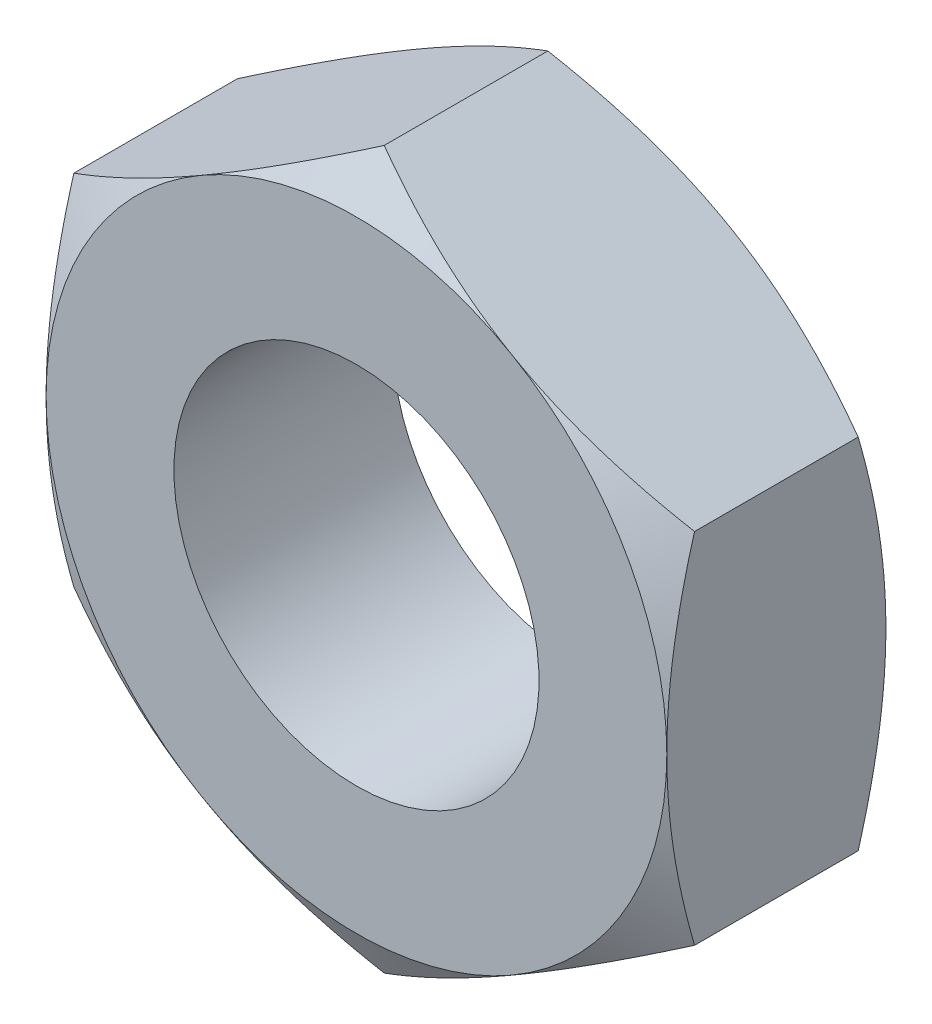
ISO-10303-21;
HEADER;
FILE_DESCRIPTION(('STEP AP214'),'2;1');
FILE_NAME('part.step','',(''),(''),'','','');
FILE_SCHEMA(('AUTOMOTIVE_DESIGN { 1 0 10303 214 1 1 1 1 }'));
ENDSEC;
DATA;
#1=APPLICATION_CONTEXT('core data for automotive mechanical design processes');
#2=APPLICATION_PROTOCOL_DEFINITION('international standard','automotive_design',2000,#1);
#3=PRODUCT_CONTEXT('',#1,'mechanical');
#4=PRODUCT('Part','Part','',(#3));
#5=PRODUCT_RELATED_PRODUCT_CATEGORY('part','',(#4));
#6=PRODUCT_DEFINITION_FORMATION('','',#4);
#7=PRODUCT_DEFINITION_CONTEXT('part definition',#1,'design');
#8=PRODUCT_DEFINITION('design','',#6,#7);
#9=PRODUCT_DEFINITION_SHAPE('','',#8);
#10=(LENGTH_UNIT() NAMED_UNIT(*) SI_UNIT(.MILLI.,.METRE.));
#11=(NAMED_UNIT(*) PLANE_ANGLE_UNIT() SI_UNIT($,.RADIAN.));
#12=(NAMED_UNIT(*) SI_UNIT($,.STERADIAN.) SOLID_ANGLE_UNIT());
#13=UNCERTAINTY_MEASURE_WITH_UNIT(LENGTH_MEASURE(1.E-05),#10,'distance_accuracy_value','');
#14=(GEOMETRIC_REPRESENTATION_CONTEXT(3) GLOBAL_UNCERTAINTY_ASSIGNED_CONTEXT((#13)) GLOBAL_UNIT_ASSIGNED_CONTEXT((#10,
#11,#12)) REPRESENTATION_CONTEXT('',''));
#15=CARTESIAN_POINT('',(0.,0.,0.));
#16=DIRECTION('',(0.,0.,1.));
#17=DIRECTION('',(1.,0.,0.));
#18=AXIS2_PLACEMENT_3D('',#15,#16,#17);
#19=CARTESIAN_POINT('',(-8.5,-4.90747728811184,8.));
#20=DIRECTION('',(-1.,0.,0.));
#21=DIRECTION('',(0.,0.,1.));
#22=AXIS2_PLACEMENT_3D('',#19,#20,#21);
#23=PLANE('',#22);
#24=CARTESIAN_POINT('',(-8.5,-13.1914833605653,4.15278822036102));
#25=CARTESIAN_POINT('',(-8.49999999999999,-12.8201614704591,3.9726260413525));
#26=CARTESIAN_POINT('',(-8.49999999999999,-12.4479882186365,3.79418857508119));
#27=CARTESIAN_POINT('',(-8.49999999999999,-11.7014862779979,3.44173285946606));
#28=CARTESIAN_POINT('',(-8.49999999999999,-11.3271572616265,3.26771530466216));
#29=CARTESIAN_POINT('',(-8.49999999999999,-10.5739668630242,2.92419570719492));
#30=CARTESIAN_POINT('',(-8.49999999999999,-10.195091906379,2.75472332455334));
#31=CARTESIAN_POINT('',(-8.49999999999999,-9.43433200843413,2.42270108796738));
#32=CARTESIAN_POINT('',(-8.49999999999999,-9.05244721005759,2.26015090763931));
#33=CARTESIAN_POINT('',(-8.49999999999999,-8.27268041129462,1.93869686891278));
#34=CARTESIAN_POINT('',(-8.5,-7.87467962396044,1.78007956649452));
#35=CARTESIAN_POINT('',(-8.5,-7.07402609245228,1.47482689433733));
#36=CARTESIAN_POINT('',(-8.5,-6.67137283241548,1.32819286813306));
#37=CARTESIAN_POINT('',(-8.5,-5.86151956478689,1.05074981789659));
#38=CARTESIAN_POINT('',(-8.5,-5.45433062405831,0.919908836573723));
#39=CARTESIAN_POINT('',(-8.5,-4.6341262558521,0.678242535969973));
#40=CARTESIAN_POINT('',(-8.5,-4.22111270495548,0.567410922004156));
#41=CARTESIAN_POINT('',(-8.5,-3.39125960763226,0.371675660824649));
#42=CARTESIAN_POINT('',(-8.50000000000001,-2.97445435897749,0.286630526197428));
#43=CARTESIAN_POINT('',(-8.50000000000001,-2.34544327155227,0.182077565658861));
#44=CARTESIAN_POINT('',(-8.50000000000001,-2.13512362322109,0.151060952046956));
#45=CARTESIAN_POINT('',(-8.50000000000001,-1.7134357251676,0.0973074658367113));
#46=CARTESIAN_POINT('',(-8.50000000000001,-1.50206757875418,0.0745697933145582));
#47=CARTESIAN_POINT('',(-8.50000000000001,-1.08133091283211,0.0381128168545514));
#48=CARTESIAN_POINT('',(-8.50000000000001,-0.871972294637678,0.0242796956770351));
#49=CARTESIAN_POINT('',(-8.50000000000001,-0.452857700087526,0.00547961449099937));
#50=CARTESIAN_POINT('',(-8.50000000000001,-0.243101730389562,0.000512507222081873));
#51=CARTESIAN_POINT('',(-8.50000000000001,0.176432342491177,-0.000437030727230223));
#52=CARTESIAN_POINT('',(-8.50000000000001,0.386210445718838,0.00358055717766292));
#53=CARTESIAN_POINT('',(-8.50000000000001,0.805410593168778,0.0205020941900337));
#54=CARTESIAN_POINT('',(-8.5,1.01483261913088,0.0334064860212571));
#55=CARTESIAN_POINT('',(-8.5,1.51786363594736,0.0748028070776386));
#56=CARTESIAN_POINT('',(-8.50000000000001,1.8111342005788,0.107496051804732));
#57=CARTESIAN_POINT('',(-8.50000000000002,2.3954909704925,0.188528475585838));
#58=CARTESIAN_POINT('',(-8.50000000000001,2.68657687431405,0.236869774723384));
#59=CARTESIAN_POINT('',(-8.50000000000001,3.55623015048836,0.402801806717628));
#60=CARTESIAN_POINT('',(-8.50000000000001,4.13086628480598,0.541270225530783));
#61=CARTESIAN_POINT('',(-8.50000000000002,4.99008476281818,0.781289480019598));
#62=CARTESIAN_POINT('',(-8.50000000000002,5.27912667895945,0.867793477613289));
#63=CARTESIAN_POINT('',(-8.50000000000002,5.85440315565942,1.04976356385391));
#64=CARTESIAN_POINT('',(-8.50000000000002,6.14063769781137,1.14522971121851));
#65=CARTESIAN_POINT('',(-8.50000000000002,6.71038957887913,1.34359429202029));
#66=CARTESIAN_POINT('',(-8.50000000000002,6.9939077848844,1.44649025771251));
#67=CARTESIAN_POINT('',(-8.50000000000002,7.55859700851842,1.65850609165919));
#68=CARTESIAN_POINT('',(-8.5,7.83976805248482,1.76762588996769));
#69=CARTESIAN_POINT('',(-8.5,8.49844159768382,2.03030530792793));
#70=CARTESIAN_POINT('',(-8.50000000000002,8.87508684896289,2.18601039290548));
#71=CARTESIAN_POINT('',(-8.50000000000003,9.62520493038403,2.50490506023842));
#72=CARTESIAN_POINT('',(-8.50000000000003,9.99867757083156,2.66809508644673));
#73=CARTESIAN_POINT('',(-8.50000000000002,10.7430342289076,3.00047500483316));
#74=CARTESIAN_POINT('',(-8.50000000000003,11.1139176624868,3.1696662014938));
#75=CARTESIAN_POINT('',(-8.50000000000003,11.8534417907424,3.51284973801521));
#76=CARTESIAN_POINT('',(-8.50000000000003,12.2220825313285,3.6868419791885));
#77=CARTESIAN_POINT('',(-8.50000000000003,12.9578850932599,4.03892529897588));
#78=CARTESIAN_POINT('',(-8.50000000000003,13.3250449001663,4.21702058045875));
#79=CARTESIAN_POINT('',(-8.50000000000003,14.0577826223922,4.57643909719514));
#80=CARTESIAN_POINT('',(-8.50000000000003,14.4233605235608,4.75776236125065));
#81=CARTESIAN_POINT('',(-8.50000000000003,15.518000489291,5.30567508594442));
#82=CARTESIAN_POINT('',(-8.50000000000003,16.2450654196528,5.676254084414));
#83=CARTESIAN_POINT('',(-8.50000000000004,17.6351990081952,6.39388133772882));
#84=CARTESIAN_POINT('',(-8.50000000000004,18.2985766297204,6.74033376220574));
#85=CARTESIAN_POINT('',(-8.50000000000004,19.622847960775,7.43800546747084));
#86=CARTESIAN_POINT('',(-8.50000000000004,20.2837415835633,7.78922491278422));
#87=CARTESIAN_POINT('',(-8.50000000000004,21.6019595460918,8.49442813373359));
#88=CARTESIAN_POINT('',(-8.50000000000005,22.259288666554,8.84840298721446));
#89=CARTESIAN_POINT('',(-8.50000000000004,23.5723555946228,9.55920796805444));
#90=CARTESIAN_POINT('',(-8.50000000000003,24.2280934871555,9.91603793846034));
#91=CARTESIAN_POINT('',(-8.5,24.8832443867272,10.2739351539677));
#92=B_SPLINE_CURVE_WITH_KNOTS('',3,(#24,#25,#26,#27,#28,#29,#30,#31,#32,#33,#34,#35,#36,#37,#38,
#39,#40,#41,#42,#43,#44,#45,#46,#47,#48,#49,#50,#51,#52,#53,#54,#55,#56,#57,#58,#59,#60,#61,#62,
#63,#64,#65,#66,#67,#68,#69,#70,#71,#72,#73,#74,#75,#76,#77,#78,#79,#80,#81,#82,#83,#84,#85,#86,
#87,#88,#89,#90,#91),.UNSPECIFIED.,.F.,.F.,(4,2,2,2,2,2,2,2,2,2,2,2,2,2,2,2,2,2,2,2,2,2,2,2,2,2,
2,2,2,2,2,2,2,4),(0.,1.23817709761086,2.47654757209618,3.72164431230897,4.96668228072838,
6.25186389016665,7.53718939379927,8.81986881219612,10.1021440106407,11.3772505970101,
12.0148965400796,12.6524808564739,13.2817447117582,13.9109981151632,14.5402528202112,
15.1695388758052,16.0543007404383,16.9391825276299,18.7099263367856,19.6149772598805,
20.5200341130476,21.4247917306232,22.3295391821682,23.552112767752,24.7747589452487,
25.9976725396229,27.2205610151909,28.4447633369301,29.6689765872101,32.1170813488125,
34.3622538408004,36.6075040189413,38.8472326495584,41.0868389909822),.UNSPECIFIED.);
#93=CARTESIAN_POINT('',(-8.5,-4.90747728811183,0.759189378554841));
#94=VERTEX_POINT('',#93);
#95=CARTESIAN_POINT('',(-8.5,0.,0.));
#96=VERTEX_POINT('',#95);
#97=EDGE_CURVE('E137',#94,#96,#92,.T.);
#98=ORIENTED_EDGE('',*,*,#97,.F.);
#99=DIRECTION('',(0.,0.,-1.));
#100=VECTOR('',#99,1.);
#101=CARTESIAN_POINT('',(-8.5,-4.90747728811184,8.));
#102=LINE('',#101,#100);
#103=CARTESIAN_POINT('',(-8.5,-4.90747728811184,5.24081062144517));
#104=VERTEX_POINT('',#103);
#105=EDGE_CURVE('E266',#104,#94,#102,.T.);
#106=ORIENTED_EDGE('',*,*,#105,.F.);
#107=CARTESIAN_POINT('',(-8.5,-13.1914833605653,1.84721177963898));
#108=CARTESIAN_POINT('',(-8.49999999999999,-12.8201614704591,2.0273739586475));
#109=CARTESIAN_POINT('',(-8.49999999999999,-12.4479882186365,2.20581142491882));
#110=CARTESIAN_POINT('',(-8.49999999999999,-11.7014862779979,2.55826714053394));
#111=CARTESIAN_POINT('',(-8.49999999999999,-11.3271572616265,2.73228469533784));
#112=CARTESIAN_POINT('',(-8.49999999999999,-10.5739668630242,3.07580429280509));
#113=CARTESIAN_POINT('',(-8.49999999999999,-10.195091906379,3.24527667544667));
#114=CARTESIAN_POINT('',(-8.49999999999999,-9.43433200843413,3.57729891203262));
#115=CARTESIAN_POINT('',(-8.49999999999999,-9.05244721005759,3.7398490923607));
#116=CARTESIAN_POINT('',(-8.49999999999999,-8.27268041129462,4.06130313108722));
#117=CARTESIAN_POINT('',(-8.5,-7.87467962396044,4.21992043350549));
#118=CARTESIAN_POINT('',(-8.5,-7.07402609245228,4.52517310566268));
#119=CARTESIAN_POINT('',(-8.5,-6.67137283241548,4.67180713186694));
#120=CARTESIAN_POINT('',(-8.5,-5.86151956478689,4.94925018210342));
#121=CARTESIAN_POINT('',(-8.5,-5.45433062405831,5.08009116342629));
#122=CARTESIAN_POINT('',(-8.5,-4.6341262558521,5.32175746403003));
#123=CARTESIAN_POINT('',(-8.5,-4.22111270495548,5.43258907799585));
#124=CARTESIAN_POINT('',(-8.5,-3.39125960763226,5.62832433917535));
#125=CARTESIAN_POINT('',(-8.5,-2.9744543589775,5.71336947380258));
#126=CARTESIAN_POINT('',(-8.5,-2.34544327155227,5.81792243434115));
#127=CARTESIAN_POINT('',(-8.50000000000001,-2.13512362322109,5.84893904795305));
#128=CARTESIAN_POINT('',(-8.50000000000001,-1.71343572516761,5.9026925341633));
#129=CARTESIAN_POINT('',(-8.50000000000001,-1.50206757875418,5.92543020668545));
#130=CARTESIAN_POINT('',(-8.50000000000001,-1.08133091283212,5.96188718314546));
#131=CARTESIAN_POINT('',(-8.50000000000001,-0.871972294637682,5.97572030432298));
#132=CARTESIAN_POINT('',(-8.50000000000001,-0.452857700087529,5.99452038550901));
#133=CARTESIAN_POINT('',(-8.50000000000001,-0.243101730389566,5.99948749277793));
#134=CARTESIAN_POINT('',(-8.50000000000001,0.176432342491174,6.00043703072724));
#135=CARTESIAN_POINT('',(-8.50000000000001,0.386210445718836,5.99641944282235));
#136=CARTESIAN_POINT('',(-8.50000000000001,0.805410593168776,5.97949790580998));
#137=CARTESIAN_POINT('',(-8.5,1.01483261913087,5.96659351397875));
#138=CARTESIAN_POINT('',(-8.5,1.51786363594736,5.92519719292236));
#139=CARTESIAN_POINT('',(-8.50000000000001,1.8111342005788,5.89250394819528));
#140=CARTESIAN_POINT('',(-8.50000000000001,2.39549097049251,5.81147152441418));
#141=CARTESIAN_POINT('',(-8.50000000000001,2.68657687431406,5.76313022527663));
#142=CARTESIAN_POINT('',(-8.50000000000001,3.55623015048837,5.59719819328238));
#143=CARTESIAN_POINT('',(-8.50000000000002,4.13086628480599,5.45872977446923));
#144=CARTESIAN_POINT('',(-8.50000000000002,4.99008476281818,5.21871051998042));
#145=CARTESIAN_POINT('',(-8.50000000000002,5.27912667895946,5.13220652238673));
#146=CARTESIAN_POINT('',(-8.50000000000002,5.85440315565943,4.95023643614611));
#147=CARTESIAN_POINT('',(-8.50000000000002,6.14063769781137,4.8547702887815));
#148=CARTESIAN_POINT('',(-8.50000000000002,6.71038957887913,4.65640570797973));
#149=CARTESIAN_POINT('',(-8.50000000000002,6.99390778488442,4.55350974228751));
#150=CARTESIAN_POINT('',(-8.50000000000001,7.55859700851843,4.34149390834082));
#151=CARTESIAN_POINT('',(-8.5,7.83976805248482,4.2323741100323));
#152=CARTESIAN_POINT('',(-8.5,8.49844159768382,3.96969469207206));
#153=CARTESIAN_POINT('',(-8.50000000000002,8.87508684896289,3.81398960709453));
#154=CARTESIAN_POINT('',(-8.50000000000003,9.62520493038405,3.4950949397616));
#155=CARTESIAN_POINT('',(-8.50000000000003,9.99867757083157,3.33190491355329));
#156=CARTESIAN_POINT('',(-8.50000000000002,10.7430342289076,2.99952499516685));
#157=CARTESIAN_POINT('',(-8.50000000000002,11.1139176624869,2.83033379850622));
#158=CARTESIAN_POINT('',(-8.50000000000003,11.8534417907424,2.48715026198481));
#159=CARTESIAN_POINT('',(-8.50000000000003,12.2220825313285,2.31315802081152));
#160=CARTESIAN_POINT('',(-8.50000000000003,12.9578850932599,1.96107470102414));
#161=CARTESIAN_POINT('',(-8.50000000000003,13.3250449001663,1.78297941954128));
#162=CARTESIAN_POINT('',(-8.50000000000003,14.0577826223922,1.42356090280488));
#163=CARTESIAN_POINT('',(-8.50000000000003,14.4233605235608,1.24223763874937));
#164=CARTESIAN_POINT('',(-8.50000000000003,15.518000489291,0.694324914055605));
#165=CARTESIAN_POINT('',(-8.50000000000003,16.2450654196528,0.323745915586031));
#166=CARTESIAN_POINT('',(-8.50000000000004,17.6351990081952,-0.393881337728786));
#167=CARTESIAN_POINT('',(-8.50000000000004,18.2985766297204,-0.740333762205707));
#168=CARTESIAN_POINT('',(-8.50000000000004,19.622847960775,-1.43800546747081));
#169=CARTESIAN_POINT('',(-8.50000000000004,20.2837415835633,-1.78922491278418));
#170=CARTESIAN_POINT('',(-8.50000000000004,21.6019595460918,-2.49442813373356));
#171=CARTESIAN_POINT('',(-8.50000000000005,22.259288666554,-2.84840298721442));
#172=CARTESIAN_POINT('',(-8.50000000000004,23.5723555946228,-3.55920796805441));
#173=CARTESIAN_POINT('',(-8.50000000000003,24.2280934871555,-3.91603793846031));
#174=CARTESIAN_POINT('',(-8.5,24.8832443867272,-4.2739351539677));
#175=B_SPLINE_CURVE_WITH_KNOTS('',3,(#107,#108,#109,#110,#111,#112,#113,#114,#115,#116,#117,
#118,#119,#120,#121,#122,#123,#124,#125,#126,#127,#128,#129,#130,#131,#132,#133,#134,#135,#136,
#137,#138,#139,#140,#141,#142,#143,#144,#145,#146,#147,#148,#149,#150,#151,#152,#153,#154,#155,
#156,#157,#158,#159,#160,#161,#162,#163,#164,#165,#166,#167,#168,#169,#170,#171,#172,#173,#174),
.UNSPECIFIED.,.F.,.F.,(4,2,2,2,2,2,2,2,2,2,2,2,2,2,2,2,2,2,2,2,2,2,2,2,2,2,2,2,2,2,2,2,2,4),(0.,
1.23817709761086,2.47654757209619,3.72164431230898,4.96668228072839,6.25186389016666,
7.53718939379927,8.81986881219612,10.1021440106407,11.3772505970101,12.0148965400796,
12.6524808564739,13.2817447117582,13.9109981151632,14.5402528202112,15.1695388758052,
16.0543007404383,16.9391825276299,18.7099263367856,19.6149772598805,20.5200341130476,
21.4247917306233,22.3295391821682,23.5521127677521,24.7747589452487,25.9976725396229,
27.220561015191,28.4447633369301,29.6689765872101,32.1170813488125,34.3622538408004,
36.6075040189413,38.8472326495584,41.0868389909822),.UNSPECIFIED.);
#176=CARTESIAN_POINT('',(-8.5,0.,6.));
#177=VERTEX_POINT('',#176);
#178=EDGE_CURVE('E220',#177,#104,#175,.F.);
#179=ORIENTED_EDGE('',*,*,#178,.F.);
#180=CARTESIAN_POINT('',(-8.5,4.90747728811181,5.24081062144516));
#181=VERTEX_POINT('',#180);
#182=EDGE_CURVE('E206',#181,#177,#175,.F.);
#183=ORIENTED_EDGE('',*,*,#182,.F.);
#184=DIRECTION('',(0.,0.,-1.));
#185=VECTOR('',#184,1.);
#186=CARTESIAN_POINT('',(-8.5,4.90747728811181,8.));
#187=LINE('',#186,#185);
#188=CARTESIAN_POINT('',(-8.5,4.90747728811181,0.759189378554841));
#189=VERTEX_POINT('',#188);
#190=EDGE_CURVE('E260',#181,#189,#187,.T.);
#191=ORIENTED_EDGE('',*,*,#190,.T.);
#192=EDGE_CURVE('E115',#96,#189,#92,.T.);
#193=ORIENTED_EDGE('',*,*,#192,.F.);
#194=EDGE_LOOP('',(#98,#106,#179,#183,#191,#193));
#195=FACE_BOUND('',#194,.T.);
#196=ADVANCED_FACE('F14',(#195),#23,.T.);
#197=CARTESIAN_POINT('',(-8.5,-4.90747728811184,8.));
#198=DIRECTION('',(0.5,0.866025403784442,0.));
#199=DIRECTION('',(-0.86602540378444,0.5,0.));
#200=AXIS2_PLACEMENT_3D('',#197,#198,#199);
#201=PLANE('',#200);
#202=ORIENTED_EDGE('',*,*,#105,.T.);
#203=CARTESIAN_POINT('',(-8.5002,-4.907361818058,0.759256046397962));
#204=CARTESIAN_POINT('',(-8.31336077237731,-5.01523349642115,0.696986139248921));
#205=CARTESIAN_POINT('',(-8.1258249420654,-5.12350735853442,0.637542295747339));
#206=CARTESIAN_POINT('',(-7.74923024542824,-5.34093440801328,0.525085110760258));
#207=CARTESIAN_POINT('',(-7.56017075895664,-5.45008795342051,0.472074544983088));
#208=CARTESIAN_POINT('',(-6.98996524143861,-5.77929626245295,0.323733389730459));
#209=CARTESIAN_POINT('',(-6.60656835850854,-6.00065055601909,0.239358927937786));
#210=CARTESIAN_POINT('',(-6.03282233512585,-6.33190297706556,0.140420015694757));
#211=CARTESIAN_POINT('',(-5.84418723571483,-6.44081150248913,0.112235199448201));
#212=CARTESIAN_POINT('',(-5.4660639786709,-6.65912106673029,0.0649740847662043));
#213=CARTESIAN_POINT('',(-5.27657589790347,-6.7685220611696,0.0458969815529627));
#214=CARTESIAN_POINT('',(-4.89727347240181,-6.98751241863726,0.017334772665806));
#215=CARTESIAN_POINT('',(-4.70745974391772,-7.09710142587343,0.00783878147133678));
#216=CARTESIAN_POINT('',(-4.32765694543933,-7.3163806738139,-0.00135762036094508));
#217=CARTESIAN_POINT('',(-4.13766788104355,-7.42607091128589,-0.00105833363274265));
#218=CARTESIAN_POINT('',(-3.78247698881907,-7.63114046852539,0.00865447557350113));
#219=CARTESIAN_POINT('',(-3.61725009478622,-7.72653426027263,0.016883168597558));
#220=CARTESIAN_POINT('',(-3.28718328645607,-7.9170984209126,0.0405892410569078));
#221=CARTESIAN_POINT('',(-3.12234339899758,-8.01226877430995,0.0560671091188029));
#222=CARTESIAN_POINT('',(-2.62846189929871,-8.29741139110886,0.113008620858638));
#223=CARTESIAN_POINT('',(-2.30029449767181,-8.48687892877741,0.164973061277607));
#224=CARTESIAN_POINT('',(-1.64047857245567,-8.86782383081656,0.29488494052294));
#225=CARTESIAN_POINT('',(-1.30891425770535,-9.05925257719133,0.373383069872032));
#226=CARTESIAN_POINT('',(-0.650730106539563,-9.43925537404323,0.551541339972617));
#227=CARTESIAN_POINT('',(-0.324101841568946,-9.62783429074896,0.651159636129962));
#228=CARTESIAN_POINT('',(0.000199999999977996,-9.81507004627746,0.759256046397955));
#229=B_SPLINE_CURVE_WITH_KNOTS('',3,(#203,#204,#205,#206,#207,#208,#209,#210,#211,#212,#213,
#214,#215,#216,#217,#218,#219,#220,#221,#222,#223,#224,#225,#226,#227,#228),.UNSPECIFIED.,.F.,
.F.,(4,2,2,2,2,2,2,2,2,2,2,2,4),(0.,0.673596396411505,1.34748239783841,2.69805431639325,
3.35679995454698,4.01548737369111,4.67342558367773,5.33134346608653,5.90409556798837,
6.4768862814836,7.62328361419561,8.79510569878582,9.96462743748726),.UNSPECIFIED.);
#230=CARTESIAN_POINT('',(-4.25,-7.36121593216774,0.));
#231=VERTEX_POINT('',#230);
#232=EDGE_CURVE('E138',#94,#231,#229,.T.);
#233=ORIENTED_EDGE('',*,*,#232,.T.);
#234=CARTESIAN_POINT('',(0.,-9.81495457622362,0.759189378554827));
#235=VERTEX_POINT('',#234);
#236=EDGE_CURVE('E123',#231,#235,#229,.T.);
#237=ORIENTED_EDGE('',*,*,#236,.T.);
#238=DIRECTION('',(0.,0.,-1.));
#239=VECTOR('',#238,1.);
#240=CARTESIAN_POINT('',(0.,-9.81495457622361,8.));
#241=LINE('',#240,#239);
#242=CARTESIAN_POINT('',(0.,-9.81495457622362,5.24081062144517));
#243=VERTEX_POINT('',#242);
#244=EDGE_CURVE('E136',#243,#235,#241,.T.);
#245=ORIENTED_EDGE('',*,*,#244,.F.);
#246=CARTESIAN_POINT('',(0.000199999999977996,-9.81507004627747,5.24074395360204));
#247=CARTESIAN_POINT('',(-0.18663922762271,-9.70719836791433,5.30301386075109));
#248=CARTESIAN_POINT('',(-0.374175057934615,-9.59892450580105,5.36245770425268));
#249=CARTESIAN_POINT('',(-0.75076975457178,-9.3814974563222,5.47491488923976));
#250=CARTESIAN_POINT('',(-0.939829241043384,-9.27234391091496,5.52792545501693));
#251=CARTESIAN_POINT('',(-1.51003475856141,-8.94313560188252,5.67626661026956));
#252=CARTESIAN_POINT('',(-1.89343164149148,-8.72178130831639,5.76064107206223));
#253=CARTESIAN_POINT('',(-2.46717766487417,-8.39052888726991,5.85957998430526));
#254=CARTESIAN_POINT('',(-2.6558127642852,-8.28162036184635,5.88776480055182));
#255=CARTESIAN_POINT('',(-3.03393602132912,-8.06331079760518,5.93502591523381));
#256=CARTESIAN_POINT('',(-3.22342410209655,-7.95390980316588,5.95410301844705));
#257=CARTESIAN_POINT('',(-3.60272652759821,-7.73491944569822,5.98266522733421));
#258=CARTESIAN_POINT('',(-3.7925402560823,-7.62533043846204,5.99216121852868));
#259=CARTESIAN_POINT('',(-4.17234305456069,-7.40605119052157,6.00135762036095));
#260=CARTESIAN_POINT('',(-4.36233211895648,-7.29636095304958,6.00105833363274));
#261=CARTESIAN_POINT('',(-4.71752301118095,-7.09129139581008,5.9913455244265));
#262=CARTESIAN_POINT('',(-4.88274990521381,-6.99589760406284,5.98311683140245));
#263=CARTESIAN_POINT('',(-5.21281671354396,-6.80533344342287,5.9594107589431));
#264=CARTESIAN_POINT('',(-5.37765660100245,-6.71016309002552,5.9439328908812));
#265=CARTESIAN_POINT('',(-5.87153810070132,-6.42502047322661,5.88699137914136));
#266=CARTESIAN_POINT('',(-6.19970550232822,-6.23555293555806,5.83502693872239));
#267=CARTESIAN_POINT('',(-6.85952142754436,-5.85460803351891,5.70511505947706));
#268=CARTESIAN_POINT('',(-7.19108574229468,-5.66317928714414,5.62661693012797));
#269=CARTESIAN_POINT('',(-7.84926989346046,-5.28317649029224,5.44845866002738));
#270=CARTESIAN_POINT('',(-8.17589815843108,-5.09459757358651,5.34884036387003));
#271=CARTESIAN_POINT('',(-8.5002,-4.907361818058,5.24074395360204));
#272=B_SPLINE_CURVE_WITH_KNOTS('',3,(#246,#247,#248,#249,#250,#251,#252,#253,#254,#255,#256,
#257,#258,#259,#260,#261,#262,#263,#264,#265,#266,#267,#268,#269,#270,#271),.UNSPECIFIED.,.F.,
.F.,(4,2,2,2,2,2,2,2,2,2,2,2,4),(0.,0.673596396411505,1.34748239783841,2.69805431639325,
3.35679995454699,4.01548737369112,4.67342558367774,5.33134346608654,5.90409556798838,
6.47688628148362,7.62328361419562,8.79510569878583,9.96462743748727),.UNSPECIFIED.);
#273=CARTESIAN_POINT('',(-4.25,-7.36121593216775,6.));
#274=VERTEX_POINT('',#273);
#275=EDGE_CURVE('E257',#243,#274,#272,.T.);
#276=ORIENTED_EDGE('',*,*,#275,.T.);
#277=EDGE_CURVE('E263',#274,#104,#272,.T.);
#278=ORIENTED_EDGE('',*,*,#277,.T.);
#279=EDGE_LOOP('',(#202,#233,#237,#245,#276,#278));
#280=FACE_BOUND('',#279,.T.);
#281=ADVANCED_FACE('F16',(#280),#201,.F.);
#282=CARTESIAN_POINT('',(8.5,-4.9074772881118,8.));
#283=DIRECTION('',(0.5,-0.866025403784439,0.));
#284=DIRECTION('',(0.866025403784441,0.5,0.));
#285=AXIS2_PLACEMENT_3D('',#282,#283,#284);
#286=PLANE('',#285);
#287=CARTESIAN_POINT('',(8.5002,-4.90736181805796,0.759256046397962));
#288=CARTESIAN_POINT('',(8.31336077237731,-5.01523349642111,0.696986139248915));
#289=CARTESIAN_POINT('',(8.1258249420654,-5.12350735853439,0.63754229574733));
#290=CARTESIAN_POINT('',(7.74923024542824,-5.34093440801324,0.525085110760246));
#291=CARTESIAN_POINT('',(7.56017075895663,-5.45008795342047,0.472074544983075));
#292=CARTESIAN_POINT('',(6.9899652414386,-5.77929626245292,0.323733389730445));
#293=CARTESIAN_POINT('',(6.60656835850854,-6.00065055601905,0.239358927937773));
#294=CARTESIAN_POINT('',(6.03282233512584,-6.33190297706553,0.140420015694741));
#295=CARTESIAN_POINT('',(5.84418723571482,-6.4408115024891,0.112235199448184));
#296=CARTESIAN_POINT('',(5.46606397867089,-6.65912106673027,0.0649740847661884));
#297=CARTESIAN_POINT('',(5.27657589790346,-6.76852206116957,0.0458969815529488));
#298=CARTESIAN_POINT('',(4.8972734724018,-6.98751241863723,0.0173347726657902));
#299=CARTESIAN_POINT('',(4.70745974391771,-7.09710142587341,0.00783878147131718));
#300=CARTESIAN_POINT('',(4.32765694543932,-7.31638067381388,-0.00135762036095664));
#301=CARTESIAN_POINT('',(4.13766788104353,-7.42607091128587,-0.00105833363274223));
#302=CARTESIAN_POINT('',(3.78247698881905,-7.63114046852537,0.00865447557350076));
#303=CARTESIAN_POINT('',(3.6172500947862,-7.72653426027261,0.0168831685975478));
#304=CARTESIAN_POINT('',(3.28718328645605,-7.91709842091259,0.0405892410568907));
#305=CARTESIAN_POINT('',(3.12234339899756,-8.01226877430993,0.0560671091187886));
#306=CARTESIAN_POINT('',(2.62846189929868,-8.29741139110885,0.113008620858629));
#307=CARTESIAN_POINT('',(2.30029449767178,-8.4868789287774,0.164973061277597));
#308=CARTESIAN_POINT('',(1.64047857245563,-8.86782383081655,0.294884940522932));
#309=CARTESIAN_POINT('',(1.30891425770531,-9.05925257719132,0.373383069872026));
#310=CARTESIAN_POINT('',(0.650730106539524,-9.43925537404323,0.551541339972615));
#311=CARTESIAN_POINT('',(0.324101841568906,-9.62783429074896,0.651159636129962));
#312=CARTESIAN_POINT('',(-0.000200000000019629,-9.81507004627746,0.759256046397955));
#313=B_SPLINE_CURVE_WITH_KNOTS('',3,(#287,#288,#289,#290,#291,#292,#293,#294,#295,#296,#297,
#298,#299,#300,#301,#302,#303,#304,#305,#306,#307,#308,#309,#310,#311,#312),.UNSPECIFIED.,.F.,
.F.,(4,2,2,2,2,2,2,2,2,2,2,2,4),(0.,0.673596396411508,1.34748239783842,2.69805431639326,
3.356799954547,4.01548737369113,4.67342558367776,5.33134346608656,5.9040955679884,
6.47688628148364,7.62328361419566,8.79510569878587,9.96462743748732),.UNSPECIFIED.);
#314=CARTESIAN_POINT('',(8.5,-4.9074772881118,0.759189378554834));
#315=VERTEX_POINT('',#314);
#316=CARTESIAN_POINT('',(4.25,-7.36121593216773,0.));
#317=VERTEX_POINT('',#316);
#318=EDGE_CURVE('E104',#315,#317,#313,.T.);
#319=ORIENTED_EDGE('',*,*,#318,.F.);
#320=DIRECTION('',(0.,0.,-1.));
#321=VECTOR('',#320,1.);
#322=CARTESIAN_POINT('',(8.5,-4.9074772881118,8.));
#323=LINE('',#322,#321);
#324=CARTESIAN_POINT('',(8.5,-4.9074772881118,5.24081062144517));
#325=VERTEX_POINT('',#324);
#326=EDGE_CURVE('E294',#325,#315,#323,.T.);
#327=ORIENTED_EDGE('',*,*,#326,.F.);
#328=CARTESIAN_POINT('',(-0.000200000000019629,-9.81507004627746,5.24074395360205));
#329=CARTESIAN_POINT('',(0.186639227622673,-9.70719836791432,5.3030138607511));
#330=CARTESIAN_POINT('',(0.37417505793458,-9.59892450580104,5.36245770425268));
#331=CARTESIAN_POINT('',(0.750769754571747,-9.38149745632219,5.47491488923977));
#332=CARTESIAN_POINT('',(0.939829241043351,-9.27234391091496,5.52792545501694));
#333=CARTESIAN_POINT('',(1.51003475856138,-8.94313560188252,5.67626661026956));
#334=CARTESIAN_POINT('',(1.89343164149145,-8.72178130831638,5.76064107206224));
#335=CARTESIAN_POINT('',(2.46717766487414,-8.3905288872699,5.85957998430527));
#336=CARTESIAN_POINT('',(2.65581276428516,-8.28162036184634,5.88776480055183));
#337=CARTESIAN_POINT('',(3.03393602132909,-8.06331079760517,5.93502591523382));
#338=CARTESIAN_POINT('',(3.22342410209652,-7.95390980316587,5.95410301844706));
#339=CARTESIAN_POINT('',(3.60272652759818,-7.7349194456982,5.98266522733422));
#340=CARTESIAN_POINT('',(3.79254025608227,-7.62533043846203,5.99216121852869));
#341=CARTESIAN_POINT('',(4.17234305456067,-7.40605119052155,6.00135762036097));
#342=CARTESIAN_POINT('',(4.36233211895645,-7.29636095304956,6.00105833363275));
#343=CARTESIAN_POINT('',(4.71752301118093,-7.09129139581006,5.99134552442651));
#344=CARTESIAN_POINT('',(4.88274990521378,-6.99589760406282,5.98311683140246));
#345=CARTESIAN_POINT('',(5.21281671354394,-6.80533344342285,5.95941075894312));
#346=CARTESIAN_POINT('',(5.37765660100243,-6.7101630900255,5.94393289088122));
#347=CARTESIAN_POINT('',(5.8715381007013,-6.42502047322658,5.88699137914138));
#348=CARTESIAN_POINT('',(6.1997055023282,-6.23555293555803,5.83502693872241));
#349=CARTESIAN_POINT('',(6.85952142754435,-5.85460803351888,5.70511505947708));
#350=CARTESIAN_POINT('',(7.19108574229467,-5.66317928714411,5.62661693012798));
#351=CARTESIAN_POINT('',(7.84926989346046,-5.2831764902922,5.44845866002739));
#352=CARTESIAN_POINT('',(8.17589815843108,-5.09459757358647,5.34884036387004));
#353=CARTESIAN_POINT('',(8.5002,-4.90736181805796,5.24074395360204));
#354=B_SPLINE_CURVE_WITH_KNOTS('',3,(#328,#329,#330,#331,#332,#333,#334,#335,#336,#337,#338,
#339,#340,#341,#342,#343,#344,#345,#346,#347,#348,#349,#350,#351,#352,#353),.UNSPECIFIED.,.F.,
.F.,(4,2,2,2,2,2,2,2,2,2,2,2,4),(0.,0.673596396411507,1.34748239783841,2.69805431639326,
3.35679995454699,4.01548737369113,4.67342558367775,5.33134346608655,5.9040955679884,
6.47688628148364,7.62328361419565,8.79510569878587,9.96462743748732),.UNSPECIFIED.);
#355=CARTESIAN_POINT('',(4.25,-7.36121593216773,6.));
#356=VERTEX_POINT('',#355);
#357=EDGE_CURVE('E308',#356,#325,#354,.T.);
#358=ORIENTED_EDGE('',*,*,#357,.F.);
#359=EDGE_CURVE('E284',#243,#356,#354,.T.);
#360=ORIENTED_EDGE('',*,*,#359,.F.);
#361=ORIENTED_EDGE('',*,*,#244,.T.);
#362=EDGE_CURVE('E117',#317,#235,#313,.T.);
#363=ORIENTED_EDGE('',*,*,#362,.F.);
#364=EDGE_LOOP('',(#319,#327,#358,#360,#361,#363));
#365=FACE_BOUND('',#364,.T.);
#366=ADVANCED_FACE('F133',(#365),#286,.T.);
#367=CARTESIAN_POINT('',(8.5,-4.9074772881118,8.));
#368=DIRECTION('',(-1.,0.,0.));
#369=DIRECTION('',(0.,0.,1.));
#370=AXIS2_PLACEMENT_3D('',#367,#368,#369);
#371=PLANE('',#370);
#372=ORIENTED_EDGE('',*,*,#326,.T.);
#373=CARTESIAN_POINT('',(8.5,-13.1914833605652,4.15278822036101));
#374=CARTESIAN_POINT('',(8.50000000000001,-12.8201614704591,3.97262604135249));
#375=CARTESIAN_POINT('',(8.50000000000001,-12.4479882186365,3.79418857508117));
#376=CARTESIAN_POINT('',(8.50000000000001,-11.7014862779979,3.44173285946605));
#377=CARTESIAN_POINT('',(8.50000000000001,-11.3271572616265,3.26771530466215));
#378=CARTESIAN_POINT('',(8.50000000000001,-10.5739668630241,2.9241957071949));
#379=CARTESIAN_POINT('',(8.50000000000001,-10.195091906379,2.75472332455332));
#380=CARTESIAN_POINT('',(8.50000000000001,-9.43433200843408,2.42270108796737));
#381=CARTESIAN_POINT('',(8.50000000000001,-9.05244721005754,2.2601509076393));
#382=CARTESIAN_POINT('',(8.50000000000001,-8.27268041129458,1.93869686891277));
#383=CARTESIAN_POINT('',(8.5,-7.8746796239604,1.78007956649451));
#384=CARTESIAN_POINT('',(8.5,-7.07402609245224,1.47482689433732));
#385=CARTESIAN_POINT('',(8.5,-6.67137283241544,1.32819286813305));
#386=CARTESIAN_POINT('',(8.5,-5.86151956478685,1.05074981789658));
#387=CARTESIAN_POINT('',(8.5,-5.45433062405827,0.919908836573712));
#388=CARTESIAN_POINT('',(8.5,-4.63412625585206,0.678242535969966));
#389=CARTESIAN_POINT('',(8.5,-4.22111270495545,0.567410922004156));
#390=CARTESIAN_POINT('',(8.5,-3.39125960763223,0.37167566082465));
#391=CARTESIAN_POINT('',(8.49999999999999,-2.97445435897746,0.286630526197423));
#392=CARTESIAN_POINT('',(8.49999999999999,-2.34544327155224,0.182077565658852));
#393=CARTESIAN_POINT('',(8.49999999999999,-2.13512362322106,0.151060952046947));
#394=CARTESIAN_POINT('',(8.49999999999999,-1.71343572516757,0.0973074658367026));
#395=CARTESIAN_POINT('',(8.49999999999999,-1.50206757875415,0.0745697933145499));
#396=CARTESIAN_POINT('',(8.49999999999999,-1.08133091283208,0.0381128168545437));
#397=CARTESIAN_POINT('',(8.49999999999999,-0.871972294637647,0.0242796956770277));
#398=CARTESIAN_POINT('',(8.49999999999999,-0.452857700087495,0.00547961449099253));
#399=CARTESIAN_POINT('',(8.49999999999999,-0.243101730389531,0.000512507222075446));
#400=CARTESIAN_POINT('',(8.49999999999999,0.176432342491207,-0.000437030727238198));
#401=CARTESIAN_POINT('',(8.49999999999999,0.386210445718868,0.003580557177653));
#402=CARTESIAN_POINT('',(8.49999999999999,0.805410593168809,0.0205020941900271));
#403=CARTESIAN_POINT('',(8.5,1.01483261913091,0.0334064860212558));
#404=CARTESIAN_POINT('',(8.5,1.51786363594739,0.0748028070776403));
#405=CARTESIAN_POINT('',(8.49999999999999,1.81113420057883,0.107496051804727));
#406=CARTESIAN_POINT('',(8.49999999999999,2.39549097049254,0.188528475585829));
#407=CARTESIAN_POINT('',(8.49999999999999,2.68657687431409,0.236869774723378));
#408=CARTESIAN_POINT('',(8.49999999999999,3.5562301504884,0.402801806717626));
#409=CARTESIAN_POINT('',(8.49999999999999,4.13086628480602,0.541270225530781));
#410=CARTESIAN_POINT('',(8.49999999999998,4.99008476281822,0.781289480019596));
#411=CARTESIAN_POINT('',(8.49999999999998,5.27912667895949,0.867793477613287));
#412=CARTESIAN_POINT('',(8.49999999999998,5.85440315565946,1.04976356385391));
#413=CARTESIAN_POINT('',(8.49999999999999,6.14063769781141,1.14522971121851));
#414=CARTESIAN_POINT('',(8.49999999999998,6.71038957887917,1.34359429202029));
#415=CARTESIAN_POINT('',(8.49999999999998,6.99390778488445,1.44649025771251));
#416=CARTESIAN_POINT('',(8.49999999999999,7.55859700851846,1.6585060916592));
#417=CARTESIAN_POINT('',(8.5,7.83976805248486,1.7676258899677));
#418=CARTESIAN_POINT('',(8.5,8.49844159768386,2.03030530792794));
#419=CARTESIAN_POINT('',(8.49999999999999,8.87508684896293,2.18601039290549));
#420=CARTESIAN_POINT('',(8.49999999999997,9.62520493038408,2.50490506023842));
#421=CARTESIAN_POINT('',(8.49999999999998,9.9986775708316,2.66809508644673));
#422=CARTESIAN_POINT('',(8.49999999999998,10.7430342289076,3.00047500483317));
#423=CARTESIAN_POINT('',(8.49999999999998,11.1139176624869,3.1696662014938));
#424=CARTESIAN_POINT('',(8.49999999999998,11.8534417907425,3.51284973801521));
#425=CARTESIAN_POINT('',(8.49999999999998,12.2220825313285,3.6868419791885));
#426=CARTESIAN_POINT('',(8.49999999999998,12.95788509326,4.03892529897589));
#427=CARTESIAN_POINT('',(8.49999999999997,13.3250449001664,4.21702058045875));
#428=CARTESIAN_POINT('',(8.49999999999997,14.0577826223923,4.57643909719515));
#429=CARTESIAN_POINT('',(8.49999999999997,14.4233605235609,4.75776236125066));
#430=CARTESIAN_POINT('',(8.49999999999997,15.518000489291,5.30567508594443));
#431=CARTESIAN_POINT('',(8.49999999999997,16.2450654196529,5.676254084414));
#432=CARTESIAN_POINT('',(8.49999999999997,17.6351990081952,6.39388133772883));
#433=CARTESIAN_POINT('',(8.49999999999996,18.2985766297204,6.74033376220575));
#434=CARTESIAN_POINT('',(8.49999999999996,19.622847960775,7.43800546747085));
#435=CARTESIAN_POINT('',(8.49999999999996,20.2837415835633,7.78922491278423));
#436=CARTESIAN_POINT('',(8.49999999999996,21.6019595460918,8.4944281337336));
#437=CARTESIAN_POINT('',(8.49999999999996,22.259288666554,8.84840298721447));
#438=CARTESIAN_POINT('',(8.49999999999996,23.5723555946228,9.55920796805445));
#439=CARTESIAN_POINT('',(8.49999999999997,24.2280934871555,9.91603793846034));
#440=CARTESIAN_POINT('',(8.5,24.8832443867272,10.2739351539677));
#441=B_SPLINE_CURVE_WITH_KNOTS('',3,(#373,#374,#375,#376,#377,#378,#379,#380,#381,#382,#383,
#384,#385,#386,#387,#388,#389,#390,#391,#392,#393,#394,#395,#396,#397,#398,#399,#400,#401,#402,
#403,#404,#405,#406,#407,#408,#409,#410,#411,#412,#413,#414,#415,#416,#417,#418,#419,#420,#421,
#422,#423,#424,#425,#426,#427,#428,#429,#430,#431,#432,#433,#434,#435,#436,#437,#438,#439,#440),
.UNSPECIFIED.,.F.,.F.,(4,2,2,2,2,2,2,2,2,2,2,2,2,2,2,2,2,2,2,2,2,2,2,2,2,2,2,2,2,2,2,2,2,4),(0.,
1.23817709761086,2.47654757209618,3.72164431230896,4.96668228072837,6.25186389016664,
7.53718939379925,8.8198688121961,10.1021440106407,11.3772505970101,12.0148965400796,
12.6524808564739,13.2817447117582,13.9109981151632,14.5402528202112,15.1695388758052,
16.0543007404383,16.9391825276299,18.7099263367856,19.6149772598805,20.5200341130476,
21.4247917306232,22.3295391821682,23.552112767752,24.7747589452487,25.9976725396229,
27.2205610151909,28.4447633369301,29.6689765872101,32.1170813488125,34.3622538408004,
36.6075040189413,38.8472326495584,41.0868389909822),.UNSPECIFIED.);
#442=CARTESIAN_POINT('',(8.5,0.,0.));
#443=VERTEX_POINT('',#442);
#444=EDGE_CURVE('E110',#315,#443,#441,.T.);
#445=ORIENTED_EDGE('',*,*,#444,.T.);
#446=CARTESIAN_POINT('',(8.5,4.90747728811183,0.759189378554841));
#447=VERTEX_POINT('',#446);
#448=EDGE_CURVE('E31',#443,#447,#441,.T.);
#449=ORIENTED_EDGE('',*,*,#448,.T.);
#450=DIRECTION('',(0.,0.,-1.));
#451=VECTOR('',#450,1.);
#452=CARTESIAN_POINT('',(8.5,4.90747728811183,8.));
#453=LINE('',#452,#451);
#454=CARTESIAN_POINT('',(8.5,4.90747728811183,5.24081062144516));
#455=VERTEX_POINT('',#454);
#456=EDGE_CURVE('E295',#455,#447,#453,.T.);
#457=ORIENTED_EDGE('',*,*,#456,.F.);
#458=CARTESIAN_POINT('',(8.5,-13.1914833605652,1.84721177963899));
#459=CARTESIAN_POINT('',(8.50000000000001,-12.8201614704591,2.02737395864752));
#460=CARTESIAN_POINT('',(8.50000000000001,-12.4479882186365,2.20581142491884));
#461=CARTESIAN_POINT('',(8.50000000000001,-11.7014862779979,2.55826714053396));
#462=CARTESIAN_POINT('',(8.50000000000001,-11.3271572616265,2.73228469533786));
#463=CARTESIAN_POINT('',(8.50000000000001,-10.5739668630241,3.07580429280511));
#464=CARTESIAN_POINT('',(8.50000000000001,-10.195091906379,3.24527667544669));
#465=CARTESIAN_POINT('',(8.50000000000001,-9.43433200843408,3.57729891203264));
#466=CARTESIAN_POINT('',(8.50000000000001,-9.05244721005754,3.73984909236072));
#467=CARTESIAN_POINT('',(8.50000000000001,-8.27268041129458,4.06130313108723));
#468=CARTESIAN_POINT('',(8.5,-7.87467962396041,4.2199204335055));
#469=CARTESIAN_POINT('',(8.5,-7.07402609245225,4.52517310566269));
#470=CARTESIAN_POINT('',(8.5,-6.67137283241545,4.67180713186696));
#471=CARTESIAN_POINT('',(8.5,-5.86151956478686,4.94925018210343));
#472=CARTESIAN_POINT('',(8.5,-5.45433062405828,5.0800911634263));
#473=CARTESIAN_POINT('',(8.5,-4.63412625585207,5.32175746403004));
#474=CARTESIAN_POINT('',(8.5,-4.22111270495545,5.43258907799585));
#475=CARTESIAN_POINT('',(8.5,-3.39125960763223,5.62832433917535));
#476=CARTESIAN_POINT('',(8.5,-2.97445435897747,5.71336947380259));
#477=CARTESIAN_POINT('',(8.5,-2.34544327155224,5.81792243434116));
#478=CARTESIAN_POINT('',(8.49999999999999,-2.13512362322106,5.84893904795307));
#479=CARTESIAN_POINT('',(8.49999999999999,-1.71343572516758,5.90269253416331));
#480=CARTESIAN_POINT('',(8.49999999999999,-1.50206757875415,5.92543020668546));
#481=CARTESIAN_POINT('',(8.49999999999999,-1.08133091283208,5.96188718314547));
#482=CARTESIAN_POINT('',(8.49999999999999,-0.87197229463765,5.97572030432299));
#483=CARTESIAN_POINT('',(8.49999999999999,-0.452857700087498,5.99452038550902));
#484=CARTESIAN_POINT('',(8.49999999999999,-0.243101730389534,5.99948749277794));
#485=CARTESIAN_POINT('',(8.49999999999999,0.176432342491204,6.00043703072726));
#486=CARTESIAN_POINT('',(8.49999999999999,0.386210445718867,5.99641944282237));
#487=CARTESIAN_POINT('',(8.49999999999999,0.805410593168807,5.97949790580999));
#488=CARTESIAN_POINT('',(8.5,1.01483261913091,5.96659351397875));
#489=CARTESIAN_POINT('',(8.5,1.51786363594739,5.92519719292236));
#490=CARTESIAN_POINT('',(8.49999999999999,1.81113420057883,5.89250394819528));
#491=CARTESIAN_POINT('',(8.49999999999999,2.39549097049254,5.81147152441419));
#492=CARTESIAN_POINT('',(8.49999999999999,2.68657687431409,5.76313022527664));
#493=CARTESIAN_POINT('',(8.49999999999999,3.5562301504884,5.59719819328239));
#494=CARTESIAN_POINT('',(8.49999999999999,4.13086628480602,5.45872977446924));
#495=CARTESIAN_POINT('',(8.49999999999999,4.99008476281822,5.21871051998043));
#496=CARTESIAN_POINT('',(8.49999999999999,5.27912667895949,5.13220652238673));
#497=CARTESIAN_POINT('',(8.49999999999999,5.85440315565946,4.95023643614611));
#498=CARTESIAN_POINT('',(8.49999999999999,6.14063769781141,4.85477028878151));
#499=CARTESIAN_POINT('',(8.49999999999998,6.71038957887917,4.65640570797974));
#500=CARTESIAN_POINT('',(8.49999999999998,6.99390778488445,4.55350974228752));
#501=CARTESIAN_POINT('',(8.49999999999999,7.55859700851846,4.34149390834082));
#502=CARTESIAN_POINT('',(8.5,7.83976805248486,4.2323741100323));
#503=CARTESIAN_POINT('',(8.5,8.49844159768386,3.96969469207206));
#504=CARTESIAN_POINT('',(8.49999999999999,8.87508684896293,3.81398960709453));
#505=CARTESIAN_POINT('',(8.49999999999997,9.62520493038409,3.49509493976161));
#506=CARTESIAN_POINT('',(8.49999999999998,9.99867757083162,3.33190491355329));
#507=CARTESIAN_POINT('',(8.49999999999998,10.7430342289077,2.99952499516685));
#508=CARTESIAN_POINT('',(8.49999999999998,11.1139176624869,2.83033379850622));
#509=CARTESIAN_POINT('',(8.49999999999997,11.8534417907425,2.48715026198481));
#510=CARTESIAN_POINT('',(8.49999999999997,12.2220825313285,2.31315802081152));
#511=CARTESIAN_POINT('',(8.49999999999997,12.95788509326,1.96107470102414));
#512=CARTESIAN_POINT('',(8.49999999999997,13.3250449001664,1.78297941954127));
#513=CARTESIAN_POINT('',(8.49999999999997,14.0577826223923,1.42356090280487));
#514=CARTESIAN_POINT('',(8.49999999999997,14.4233605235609,1.24223763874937));
#515=CARTESIAN_POINT('',(8.49999999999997,15.5180004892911,0.694324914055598));
#516=CARTESIAN_POINT('',(8.49999999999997,16.2450654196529,0.323745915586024));
#517=CARTESIAN_POINT('',(8.49999999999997,17.6351990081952,-0.393881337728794));
#518=CARTESIAN_POINT('',(8.49999999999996,18.2985766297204,-0.740333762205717));
#519=CARTESIAN_POINT('',(8.49999999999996,19.622847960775,-1.43800546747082));
#520=CARTESIAN_POINT('',(8.49999999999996,20.2837415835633,-1.78922491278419));
#521=CARTESIAN_POINT('',(8.49999999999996,21.6019595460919,-2.49442813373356));
#522=CARTESIAN_POINT('',(8.49999999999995,22.259288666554,-2.84840298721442));
#523=CARTESIAN_POINT('',(8.49999999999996,23.5723555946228,-3.55920796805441));
#524=CARTESIAN_POINT('',(8.49999999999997,24.2280934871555,-3.91603793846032));
#525=CARTESIAN_POINT('',(8.5,24.8832443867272,-4.2739351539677));
#526=B_SPLINE_CURVE_WITH_KNOTS('',3,(#458,#459,#460,#461,#462,#463,#464,#465,#466,#467,#468,
#469,#470,#471,#472,#473,#474,#475,#476,#477,#478,#479,#480,#481,#482,#483,#484,#485,#486,#487,
#488,#489,#490,#491,#492,#493,#494,#495,#496,#497,#498,#499,#500,#501,#502,#503,#504,#505,#506,
#507,#508,#509,#510,#511,#512,#513,#514,#515,#516,#517,#518,#519,#520,#521,#522,#523,#524,#525),
.UNSPECIFIED.,.F.,.F.,(4,2,2,2,2,2,2,2,2,2,2,2,2,2,2,2,2,2,2,2,2,2,2,2,2,2,2,2,2,2,2,2,2,4),(0.,
1.23817709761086,2.47654757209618,3.72164431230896,4.96668228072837,6.25186389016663,
7.53718939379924,8.81986881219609,10.1021440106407,11.3772505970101,12.0148965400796,
12.6524808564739,13.2817447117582,13.9109981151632,14.5402528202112,15.1695388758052,
16.0543007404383,16.9391825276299,18.7099263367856,19.6149772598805,20.5200341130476,
21.4247917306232,22.3295391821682,23.552112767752,24.7747589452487,25.9976725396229,
27.2205610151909,28.4447633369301,29.6689765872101,32.1170813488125,34.3622538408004,
36.6075040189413,38.8472326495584,41.0868389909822),.UNSPECIFIED.);
#527=CARTESIAN_POINT('',(8.5,0.,6.));
#528=VERTEX_POINT('',#527);
#529=EDGE_CURVE('E221',#455,#528,#526,.F.);
#530=ORIENTED_EDGE('',*,*,#529,.T.);
#531=EDGE_CURVE('E313',#528,#325,#526,.F.);
#532=ORIENTED_EDGE('',*,*,#531,.T.);
#533=EDGE_LOOP('',(#372,#445,#449,#457,#530,#532));
#534=FACE_BOUND('',#533,.T.);
#535=ADVANCED_FACE('F192',(#534),#371,.F.);
#536=CARTESIAN_POINT('',(8.5,4.90747728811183,8.));
#537=DIRECTION('',(-0.5,-0.866025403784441,0.));
#538=DIRECTION('',(0.866025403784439,-0.5,0.));
#539=AXIS2_PLACEMENT_3D('',#536,#537,#538);
#540=PLANE('',#539);
#541=ORIENTED_EDGE('',*,*,#456,.T.);
#542=CARTESIAN_POINT('',(8.5002,4.907361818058,0.759256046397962));
#543=CARTESIAN_POINT('',(8.3133607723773,5.01523349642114,0.69698613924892));
#544=CARTESIAN_POINT('',(8.1258249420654,5.12350735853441,0.637542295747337));
#545=CARTESIAN_POINT('',(7.74923024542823,5.34093440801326,0.525085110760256));
#546=CARTESIAN_POINT('',(7.56017075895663,5.4500879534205,0.472074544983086));
#547=CARTESIAN_POINT('',(6.9899652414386,5.77929626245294,0.323733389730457));
#548=CARTESIAN_POINT('',(6.60656835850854,6.00065055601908,0.239358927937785));
#549=CARTESIAN_POINT('',(6.03282233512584,6.33190297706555,0.140420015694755));
#550=CARTESIAN_POINT('',(5.84418723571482,6.44081150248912,0.112235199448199));
#551=CARTESIAN_POINT('',(5.46606397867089,6.65912106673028,0.0649740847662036));
#552=CARTESIAN_POINT('',(5.27657589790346,6.76852206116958,0.0458969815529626));
#553=CARTESIAN_POINT('',(4.8972734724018,6.98751241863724,0.0173347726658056));
#554=CARTESIAN_POINT('',(4.70745974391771,7.09710142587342,0.00783878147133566));
#555=CARTESIAN_POINT('',(4.32765694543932,7.31638067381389,-0.00135762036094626));
#556=CARTESIAN_POINT('',(4.13766788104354,7.42607091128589,-0.00105833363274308));
#557=CARTESIAN_POINT('',(3.78247698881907,7.63114046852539,0.0086544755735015));
#558=CARTESIAN_POINT('',(3.61725009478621,7.72653426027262,0.0168831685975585));
#559=CARTESIAN_POINT('',(3.28718328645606,7.91709842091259,0.0405892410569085));
#560=CARTESIAN_POINT('',(3.12234339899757,8.01226877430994,0.0560671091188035));
#561=CARTESIAN_POINT('',(2.6284618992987,8.29741139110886,0.113008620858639));
#562=CARTESIAN_POINT('',(2.3002944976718,8.48687892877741,0.164973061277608));
#563=CARTESIAN_POINT('',(1.64047857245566,8.86782383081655,0.294884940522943));
#564=CARTESIAN_POINT('',(1.30891425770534,9.05925257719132,0.373383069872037));
#565=CARTESIAN_POINT('',(0.650730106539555,9.43925537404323,0.551541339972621));
#566=CARTESIAN_POINT('',(0.32410184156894,9.62783429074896,0.651159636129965));
#567=CARTESIAN_POINT('',(-0.000199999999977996,9.81507004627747,0.759256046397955));
#568=B_SPLINE_CURVE_WITH_KNOTS('',3,(#542,#543,#544,#545,#546,#547,#548,#549,#550,#551,#552,
#553,#554,#555,#556,#557,#558,#559,#560,#561,#562,#563,#564,#565,#566,#567),.UNSPECIFIED.,.F.,
.F.,(4,2,2,2,2,2,2,2,2,2,2,2,4),(0.,0.673596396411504,1.34748239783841,2.69805431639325,
3.35679995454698,4.01548737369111,4.67342558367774,5.33134346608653,5.90409556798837,
6.47688628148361,7.62328361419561,8.79510569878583,9.96462743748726),.UNSPECIFIED.);
#569=CARTESIAN_POINT('',(4.25,7.36121593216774,0.));
#570=VERTEX_POINT('',#569);
#571=EDGE_CURVE('E186',#447,#570,#568,.T.);
#572=ORIENTED_EDGE('',*,*,#571,.T.);
#573=CARTESIAN_POINT('',(0.,9.81495457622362,0.759189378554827));
#574=VERTEX_POINT('',#573);
#575=EDGE_CURVE('E38',#570,#574,#568,.T.);
#576=ORIENTED_EDGE('',*,*,#575,.T.);
#577=DIRECTION('',(0.,0.,-1.));
#578=VECTOR('',#577,1.);
#579=CARTESIAN_POINT('',(0.,9.8149545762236,8.));
#580=LINE('',#579,#578);
#581=CARTESIAN_POINT('',(0.,9.81495457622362,5.24081062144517));
#582=VERTEX_POINT('',#581);
#583=EDGE_CURVE('E300',#582,#574,#580,.T.);
#584=ORIENTED_EDGE('',*,*,#583,.F.);
#585=CARTESIAN_POINT('',(-0.000199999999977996,9.81507004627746,5.24074395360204));
#586=CARTESIAN_POINT('',(0.186639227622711,9.70719836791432,5.3030138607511));
#587=CARTESIAN_POINT('',(0.374175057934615,9.59892450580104,5.36245770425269));
#588=CARTESIAN_POINT('',(0.75076975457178,9.38149745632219,5.47491488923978));
#589=CARTESIAN_POINT('',(0.939829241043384,9.27234391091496,5.52792545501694));
#590=CARTESIAN_POINT('',(1.51003475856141,8.94313560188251,5.67626661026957));
#591=CARTESIAN_POINT('',(1.89343164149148,8.72178130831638,5.76064107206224));
#592=CARTESIAN_POINT('',(2.46717766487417,8.39052888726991,5.85957998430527));
#593=CARTESIAN_POINT('',(2.6558127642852,8.28162036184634,5.88776480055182));
#594=CARTESIAN_POINT('',(3.03393602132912,8.06331079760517,5.93502591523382));
#595=CARTESIAN_POINT('',(3.22342410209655,7.95390980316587,5.95410301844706));
#596=CARTESIAN_POINT('',(3.60272652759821,7.73491944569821,5.98266522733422));
#597=CARTESIAN_POINT('',(3.7925402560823,7.62533043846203,5.99216121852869));
#598=CARTESIAN_POINT('',(4.17234305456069,7.40605119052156,6.00135762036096));
#599=CARTESIAN_POINT('',(4.36233211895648,7.29636095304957,6.00105833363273));
#600=CARTESIAN_POINT('',(4.71752301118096,7.09129139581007,5.99134552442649));
#601=CARTESIAN_POINT('',(4.88274990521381,6.99589760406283,5.98311683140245));
#602=CARTESIAN_POINT('',(5.21281671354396,6.80533344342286,5.95941075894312));
#603=CARTESIAN_POINT('',(5.37765660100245,6.71016309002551,5.94393289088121));
#604=CARTESIAN_POINT('',(5.87153810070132,6.42502047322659,5.88699137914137));
#605=CARTESIAN_POINT('',(6.19970550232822,6.23555293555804,5.8350269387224));
#606=CARTESIAN_POINT('',(6.85952142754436,5.8546080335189,5.70511505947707));
#607=CARTESIAN_POINT('',(7.19108574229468,5.66317928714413,5.62661693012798));
#608=CARTESIAN_POINT('',(7.84926989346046,5.28317649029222,5.44845866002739));
#609=CARTESIAN_POINT('',(8.17589815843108,5.0945975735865,5.34884036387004));
#610=CARTESIAN_POINT('',(8.5002,4.90736181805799,5.24074395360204));
#611=B_SPLINE_CURVE_WITH_KNOTS('',3,(#585,#586,#587,#588,#589,#590,#591,#592,#593,#594,#595,
#596,#597,#598,#599,#600,#601,#602,#603,#604,#605,#606,#607,#608,#609,#610),.UNSPECIFIED.,.F.,
.F.,(4,2,2,2,2,2,2,2,2,2,2,2,4),(0.,0.673596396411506,1.34748239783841,2.69805431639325,
3.35679995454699,4.01548737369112,4.67342558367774,5.33134346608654,5.90409556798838,
6.47688628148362,7.62328361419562,8.79510569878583,9.96462743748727),.UNSPECIFIED.);
#612=CARTESIAN_POINT('',(4.25,7.36121593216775,6.));
#613=VERTEX_POINT('',#612);
#614=EDGE_CURVE('E198',#582,#613,#611,.T.);
#615=ORIENTED_EDGE('',*,*,#614,.T.);
#616=EDGE_CURVE('E208',#613,#455,#611,.T.);
#617=ORIENTED_EDGE('',*,*,#616,.T.);
#618=EDGE_LOOP('',(#541,#572,#576,#584,#615,#617));
#619=FACE_BOUND('',#618,.T.);
#620=ADVANCED_FACE('F188',(#619),#540,.F.);
#621=CARTESIAN_POINT('',(-8.5,4.90747728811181,8.));
#622=DIRECTION('',(-0.5,0.86602540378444,0.));
#623=DIRECTION('',(-0.866025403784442,-0.5,0.));
#624=AXIS2_PLACEMENT_3D('',#621,#622,#623);
#625=PLANE('',#624);
#626=CARTESIAN_POINT('',(-8.5002,4.90736181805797,0.759256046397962));
#627=CARTESIAN_POINT('',(-8.31336077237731,5.01523349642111,0.696986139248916));
#628=CARTESIAN_POINT('',(-8.1258249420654,5.12350735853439,0.637542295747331));
#629=CARTESIAN_POINT('',(-7.74923024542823,5.34093440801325,0.525085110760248));
#630=CARTESIAN_POINT('',(-7.56017075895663,5.45008795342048,0.472074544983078));
#631=CARTESIAN_POINT('',(-6.9899652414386,5.77929626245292,0.323733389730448));
#632=CARTESIAN_POINT('',(-6.60656835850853,6.00065055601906,0.239358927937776));
#633=CARTESIAN_POINT('',(-6.03282233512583,6.33190297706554,0.140420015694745));
#634=CARTESIAN_POINT('',(-5.84418723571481,6.44081150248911,0.112235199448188));
#635=CARTESIAN_POINT('',(-5.46606397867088,6.65912106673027,0.0649740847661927));
#636=CARTESIAN_POINT('',(-5.27657589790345,6.76852206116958,0.0458969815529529));
#637=CARTESIAN_POINT('',(-4.89727347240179,6.98751241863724,0.0173347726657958));
#638=CARTESIAN_POINT('',(-4.7074597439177,7.09710142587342,0.00783878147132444));
#639=CARTESIAN_POINT('',(-4.3276569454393,7.31638067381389,-0.00135762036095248));
#640=CARTESIAN_POINT('',(-4.13766788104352,7.42607091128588,-0.00105833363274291));
#641=CARTESIAN_POINT('',(-3.78247698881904,7.63114046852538,0.00865447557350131));
#642=CARTESIAN_POINT('',(-3.61725009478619,7.72653426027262,0.016883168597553));
#643=CARTESIAN_POINT('',(-3.28718328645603,7.91709842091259,0.0405892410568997));
#644=CARTESIAN_POINT('',(-3.12234339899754,8.01226877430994,0.0560671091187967));
#645=CARTESIAN_POINT('',(-2.62846189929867,8.29741139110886,0.113008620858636));
#646=CARTESIAN_POINT('',(-2.30029449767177,8.48687892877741,0.164973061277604));
#647=CARTESIAN_POINT('',(-1.64047857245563,8.86782383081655,0.29488494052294));
#648=CARTESIAN_POINT('',(-1.30891425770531,9.05925257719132,0.373383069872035));
#649=CARTESIAN_POINT('',(-0.650730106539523,9.43925537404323,0.551541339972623));
#650=CARTESIAN_POINT('',(-0.324101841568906,9.62783429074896,0.651159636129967));
#651=CARTESIAN_POINT('',(0.000200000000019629,9.81507004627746,0.759256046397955));
#652=B_SPLINE_CURVE_WITH_KNOTS('',3,(#626,#627,#628,#629,#630,#631,#632,#633,#634,#635,#636,
#637,#638,#639,#640,#641,#642,#643,#644,#645,#646,#647,#648,#649,#650,#651),.UNSPECIFIED.,.F.,
.F.,(4,2,2,2,2,2,2,2,2,2,2,2,4),(0.,0.67359639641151,1.34748239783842,2.69805431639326,
3.35679995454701,4.01548737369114,4.67342558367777,5.33134346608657,5.90409556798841,
6.47688628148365,7.62328361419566,8.79510569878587,9.96462743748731),.UNSPECIFIED.);
#653=CARTESIAN_POINT('',(-4.25,7.36121593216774,0.));
#654=VERTEX_POINT('',#653);
#655=EDGE_CURVE('E187',#189,#654,#652,.T.);
#656=ORIENTED_EDGE('',*,*,#655,.F.);
#657=ORIENTED_EDGE('',*,*,#190,.F.);
#658=CARTESIAN_POINT('',(0.000200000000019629,9.81507004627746,5.24074395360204));
#659=CARTESIAN_POINT('',(-0.186639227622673,9.70719836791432,5.3030138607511));
#660=CARTESIAN_POINT('',(-0.37417505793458,9.59892450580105,5.36245770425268));
#661=CARTESIAN_POINT('',(-0.750769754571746,9.3814974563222,5.47491488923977));
#662=CARTESIAN_POINT('',(-0.93982924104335,9.27234391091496,5.52792545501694));
#663=CARTESIAN_POINT('',(-1.51003475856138,8.94313560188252,5.67626661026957));
#664=CARTESIAN_POINT('',(-1.89343164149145,8.72178130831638,5.76064107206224));
#665=CARTESIAN_POINT('',(-2.46717766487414,8.39052888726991,5.85957998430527));
#666=CARTESIAN_POINT('',(-2.65581276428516,8.28162036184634,5.88776480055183));
#667=CARTESIAN_POINT('',(-3.03393602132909,8.06331079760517,5.93502591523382));
#668=CARTESIAN_POINT('',(-3.22342410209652,7.95390980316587,5.95410301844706));
#669=CARTESIAN_POINT('',(-3.60272652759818,7.73491944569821,5.98266522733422));
#670=CARTESIAN_POINT('',(-3.79254025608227,7.62533043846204,5.9921612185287));
#671=CARTESIAN_POINT('',(-4.17234305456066,7.40605119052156,6.00135762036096));
#672=CARTESIAN_POINT('',(-4.36233211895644,7.29636095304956,6.00105833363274));
#673=CARTESIAN_POINT('',(-4.71752301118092,7.09129139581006,5.9913455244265));
#674=CARTESIAN_POINT('',(-4.88274990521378,6.99589760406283,5.98311683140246));
#675=CARTESIAN_POINT('',(-5.21281671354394,6.80533344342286,5.95941075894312));
#676=CARTESIAN_POINT('',(-5.37765660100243,6.71016309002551,5.94393289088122));
#677=CARTESIAN_POINT('',(-5.8715381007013,6.42502047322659,5.88699137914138));
#678=CARTESIAN_POINT('',(-6.1997055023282,6.23555293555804,5.83502693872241));
#679=CARTESIAN_POINT('',(-6.85952142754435,5.85460803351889,5.70511505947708));
#680=CARTESIAN_POINT('',(-7.19108574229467,5.66317928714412,5.62661693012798));
#681=CARTESIAN_POINT('',(-7.84926989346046,5.28317649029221,5.44845866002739));
#682=CARTESIAN_POINT('',(-8.17589815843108,5.09459757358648,5.34884036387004));
#683=CARTESIAN_POINT('',(-8.5002,4.90736181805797,5.24074395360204));
#684=B_SPLINE_CURVE_WITH_KNOTS('',3,(#658,#659,#660,#661,#662,#663,#664,#665,#666,#667,#668,
#669,#670,#671,#672,#673,#674,#675,#676,#677,#678,#679,#680,#681,#682,#683),.UNSPECIFIED.,.F.,
.F.,(4,2,2,2,2,2,2,2,2,2,2,2,4),(0.,0.673596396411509,1.34748239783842,2.69805431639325,
3.35679995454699,4.01548737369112,4.67342558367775,5.33134346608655,5.90409556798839,
6.47688628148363,7.62328361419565,8.79510569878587,9.96462743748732),.UNSPECIFIED.);
#685=CARTESIAN_POINT('',(-4.24999999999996,7.36121593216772,6.));
#686=VERTEX_POINT('',#685);
#687=EDGE_CURVE('E209',#686,#181,#684,.T.);
#688=ORIENTED_EDGE('',*,*,#687,.F.);
#689=EDGE_CURVE('E207',#582,#686,#684,.T.);
#690=ORIENTED_EDGE('',*,*,#689,.F.);
#691=ORIENTED_EDGE('',*,*,#583,.T.);
#692=EDGE_CURVE('E171',#654,#574,#652,.T.);
#693=ORIENTED_EDGE('',*,*,#692,.F.);
#694=EDGE_LOOP('',(#656,#657,#688,#690,#691,#693));
#695=FACE_BOUND('',#694,.T.);
#696=ADVANCED_FACE('F191',(#695),#625,.T.);
#697=CARTESIAN_POINT('',(0.,0.,8.));
#698=DIRECTION('',(0.,0.,-1.));
#699=DIRECTION('',(0.,-1.,0.));
#700=AXIS2_PLACEMENT_3D('',#697,#698,#699);
#701=CYLINDRICAL_SURFACE('',#700,5.);
#702=CARTESIAN_POINT('',(0.,0.,0.));
#703=DIRECTION('',(0.,0.,-1.));
#704=DIRECTION('',(0.,-1.,0.));
#705=AXIS2_PLACEMENT_3D('',#702,#703,#704);
#706=CIRCLE('',#705,5.);
#707=CARTESIAN_POINT('',(0.,-5.,0.));
#708=VERTEX_POINT('',#707);
#709=EDGE_CURVE('E256',#708,#708,#706,.T.);
#710=ORIENTED_EDGE('',*,*,#709,.T.);
#711=EDGE_LOOP('',(#710));
#712=FACE_BOUND('',#711,.T.);
#713=CARTESIAN_POINT('',(0.,0.,6.));
#714=DIRECTION('',(0.,0.,1.));
#715=DIRECTION('',(0.,1.,0.));
#716=AXIS2_PLACEMENT_3D('',#713,#714,#715);
#717=CIRCLE('',#716,5.);
#718=CARTESIAN_POINT('',(0.,5.,6.));
#719=VERTEX_POINT('',#718);
#720=EDGE_CURVE('E254',#719,#719,#717,.F.);
#721=ORIENTED_EDGE('',*,*,#720,.F.);
#722=EDGE_LOOP('',(#721));
#723=FACE_BOUND('',#722,.T.);
#724=ADVANCED_FACE('F235',(#712,#723),#701,.F.);
#725=CARTESIAN_POINT('',(-8.5,4.90747728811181,0.));
#726=DIRECTION('',(0.,0.,-1.));
#727=DIRECTION('',(0.,-1.,0.));
#728=AXIS2_PLACEMENT_3D('',#725,#726,#727);
#729=PLANE('',#728);
#730=CARTESIAN_POINT('',(0.,0.,0.));
#731=DIRECTION('',(0.,0.,-1.));
#732=DIRECTION('',(0.,-1.,0.));
#733=AXIS2_PLACEMENT_3D('',#730,#731,#732);
#734=CIRCLE('',#733,8.5);
#735=EDGE_CURVE('E9',#317,#443,#734,.F.);
#736=ORIENTED_EDGE('',*,*,#735,.F.);
#737=EDGE_CURVE('E19',#231,#317,#734,.F.);
#738=ORIENTED_EDGE('',*,*,#737,.F.);
#739=EDGE_CURVE('E127',#96,#231,#734,.F.);
#740=ORIENTED_EDGE('',*,*,#739,.F.);
#741=CARTESIAN_POINT('',(0.,0.,0.));
#742=DIRECTION('',(0.,0.,1.));
#743=DIRECTION('',(0.,1.,0.));
#744=AXIS2_PLACEMENT_3D('',#741,#742,#743);
#745=CIRCLE('',#744,8.5);
#746=EDGE_CURVE('E323',#654,#96,#745,.T.);
#747=ORIENTED_EDGE('',*,*,#746,.F.);
#748=EDGE_CURVE('E321',#570,#654,#734,.F.);
#749=ORIENTED_EDGE('',*,*,#748,.F.);
#750=EDGE_CURVE('E24',#443,#570,#734,.F.);
#751=ORIENTED_EDGE('',*,*,#750,.F.);
#752=EDGE_LOOP('',(#736,#738,#740,#747,#749,#751));
#753=FACE_BOUND('',#752,.T.);
#754=ORIENTED_EDGE('',*,*,#709,.F.);
#755=EDGE_LOOP('',(#754));
#756=FACE_BOUND('',#755,.T.);
#757=ADVANCED_FACE('F129',(#753,#756),#729,.T.);
#758=CARTESIAN_POINT('',(-8.5,4.90747728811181,6.));
#759=DIRECTION('',(0.,0.,1.));
#760=DIRECTION('',(0.,1.,0.));
#761=AXIS2_PLACEMENT_3D('',#758,#759,#760);
#762=PLANE('',#761);
#763=CARTESIAN_POINT('',(0.,0.,6.));
#764=DIRECTION('',(0.,0.,1.));
#765=DIRECTION('',(0.,1.,0.));
#766=AXIS2_PLACEMENT_3D('',#763,#764,#765);
#767=CIRCLE('',#766,8.5);
#768=EDGE_CURVE('E128',#613,#528,#767,.F.);
#769=ORIENTED_EDGE('',*,*,#768,.F.);
#770=EDGE_CURVE('E268',#686,#613,#767,.F.);
#771=ORIENTED_EDGE('',*,*,#770,.F.);
#772=CARTESIAN_POINT('',(0.,0.,6.));
#773=DIRECTION('',(0.,0.,1.));
#774=DIRECTION('',(0.,1.,0.));
#775=AXIS2_PLACEMENT_3D('',#772,#773,#774);
#776=CIRCLE('',#775,8.5);
#777=EDGE_CURVE('E288',#686,#177,#776,.T.);
#778=ORIENTED_EDGE('',*,*,#777,.T.);
#779=EDGE_CURVE('E270',#274,#177,#767,.F.);
#780=ORIENTED_EDGE('',*,*,#779,.F.);
#781=EDGE_CURVE('E273',#356,#274,#767,.F.);
#782=ORIENTED_EDGE('',*,*,#781,.F.);
#783=EDGE_CURVE('E275',#528,#356,#767,.F.);
#784=ORIENTED_EDGE('',*,*,#783,.F.);
#785=EDGE_LOOP('',(#769,#771,#778,#780,#782,#784));
#786=FACE_BOUND('',#785,.T.);
#787=ORIENTED_EDGE('',*,*,#720,.T.);
#788=EDGE_LOOP('',(#787));
#789=FACE_BOUND('',#788,.T.);
#790=ADVANCED_FACE('F234',(#786,#789),#762,.T.);
#791=CARTESIAN_POINT('',(0.,0.,3.97686952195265));
#792=DIRECTION('',(0.,0.,-1.));
#793=DIRECTION('',(0.,-1.,0.));
#794=AXIS2_PLACEMENT_3D('',#791,#792,#793);
#795=CONICAL_SURFACE('',#794,12.0041647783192,1.0471975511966);
#796=ORIENTED_EDGE('',*,*,#689,.T.);
#797=ORIENTED_EDGE('',*,*,#770,.T.);
#798=ORIENTED_EDGE('',*,*,#614,.F.);
#799=EDGE_LOOP('',(#796,#797,#798));
#800=FACE_BOUND('',#799,.T.);
#801=ADVANCED_FACE('F239',(#800),#795,.T.);
#802=ORIENTED_EDGE('',*,*,#182,.T.);
#803=ORIENTED_EDGE('',*,*,#777,.F.);
#804=ORIENTED_EDGE('',*,*,#687,.T.);
#805=EDGE_LOOP('',(#802,#803,#804));
#806=FACE_BOUND('',#805,.T.);
#807=ADVANCED_FACE('F165',(#806),#795,.T.);
#808=ORIENTED_EDGE('',*,*,#779,.T.);
#809=ORIENTED_EDGE('',*,*,#178,.T.);
#810=ORIENTED_EDGE('',*,*,#277,.F.);
#811=EDGE_LOOP('',(#808,#809,#810));
#812=FACE_BOUND('',#811,.T.);
#813=ADVANCED_FACE('F352',(#812),#795,.T.);
#814=ORIENTED_EDGE('',*,*,#359,.T.);
#815=ORIENTED_EDGE('',*,*,#781,.T.);
#816=ORIENTED_EDGE('',*,*,#275,.F.);
#817=EDGE_LOOP('',(#814,#815,#816));
#818=FACE_BOUND('',#817,.T.);
#819=ADVANCED_FACE('F283',(#818),#795,.T.);
#820=ORIENTED_EDGE('',*,*,#357,.T.);
#821=ORIENTED_EDGE('',*,*,#531,.F.);
#822=ORIENTED_EDGE('',*,*,#783,.T.);
#823=EDGE_LOOP('',(#820,#821,#822));
#824=FACE_BOUND('',#823,.T.);
#825=ADVANCED_FACE('F247',(#824),#795,.T.);
#826=ORIENTED_EDGE('',*,*,#616,.F.);
#827=ORIENTED_EDGE('',*,*,#768,.T.);
#828=ORIENTED_EDGE('',*,*,#529,.F.);
#829=EDGE_LOOP('',(#826,#827,#828));
#830=FACE_BOUND('',#829,.T.);
#831=ADVANCED_FACE('F347',(#830),#795,.T.);
#832=CARTESIAN_POINT('',(0.,0.,0.));
#833=DIRECTION('',(0.,0.,1.));
#834=DIRECTION('',(0.,1.,0.));
#835=AXIS2_PLACEMENT_3D('',#832,#833,#834);
#836=CONICAL_SURFACE('',#835,8.5,1.0471975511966);
#837=ORIENTED_EDGE('',*,*,#737,.T.);
#838=ORIENTED_EDGE('',*,*,#362,.T.);
#839=ORIENTED_EDGE('',*,*,#236,.F.);
#840=EDGE_LOOP('',(#837,#838,#839));
#841=FACE_BOUND('',#840,.T.);
#842=ADVANCED_FACE('F121',(#841),#836,.T.);
#843=ORIENTED_EDGE('',*,*,#97,.T.);
#844=ORIENTED_EDGE('',*,*,#739,.T.);
#845=ORIENTED_EDGE('',*,*,#232,.F.);
#846=EDGE_LOOP('',(#843,#844,#845));
#847=FACE_BOUND('',#846,.T.);
#848=ADVANCED_FACE('F163',(#847),#836,.T.);
#849=ORIENTED_EDGE('',*,*,#192,.T.);
#850=ORIENTED_EDGE('',*,*,#655,.T.);
#851=ORIENTED_EDGE('',*,*,#746,.T.);
#852=EDGE_LOOP('',(#849,#850,#851));
#853=FACE_BOUND('',#852,.T.);
#854=ADVANCED_FACE('F332',(#853),#836,.T.);
#855=ORIENTED_EDGE('',*,*,#748,.T.);
#856=ORIENTED_EDGE('',*,*,#692,.T.);
#857=ORIENTED_EDGE('',*,*,#575,.F.);
#858=EDGE_LOOP('',(#855,#856,#857));
#859=FACE_BOUND('',#858,.T.);
#860=ADVANCED_FACE('F164',(#859),#836,.T.);
#861=ORIENTED_EDGE('',*,*,#750,.T.);
#862=ORIENTED_EDGE('',*,*,#571,.F.);
#863=ORIENTED_EDGE('',*,*,#448,.F.);
#864=EDGE_LOOP('',(#861,#862,#863));
#865=FACE_BOUND('',#864,.T.);
#866=ADVANCED_FACE('F162',(#865),#836,.T.);
#867=ORIENTED_EDGE('',*,*,#318,.T.);
#868=ORIENTED_EDGE('',*,*,#735,.T.);
#869=ORIENTED_EDGE('',*,*,#444,.F.);
#870=EDGE_LOOP('',(#867,#868,#869));
#871=FACE_BOUND('',#870,.T.);
#872=ADVANCED_FACE('F106',(#871),#836,.T.);
#873=CLOSED_SHELL('',(#196,#281,#366,#535,#620,#696,#724,#757,#790,#801,#807,#813,#819,#825,
#831,#842,#848,#854,#860,#866,#872));
#874=MANIFOLD_SOLID_BREP('B1',#873);
#875=ADVANCED_BREP_SHAPE_REPRESENTATION('',(#18,#874),#14);
#876=SHAPE_DEFINITION_REPRESENTATION(#9,#875);
ENDSEC;
END-ISO-10303-21;
